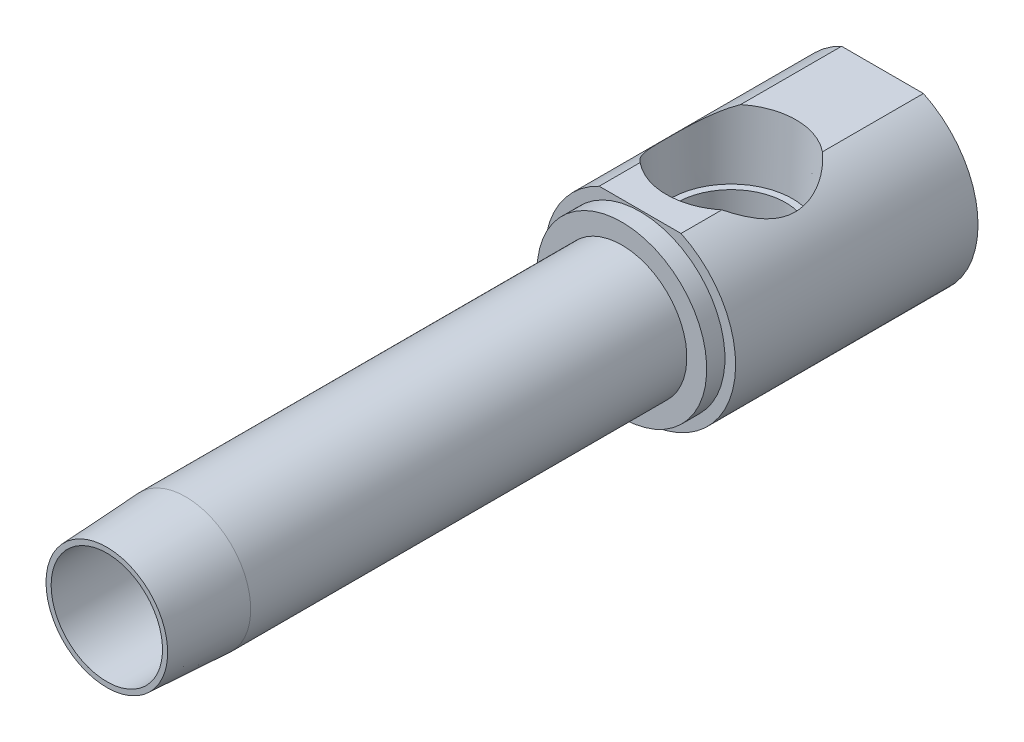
ISO-10303-21;
HEADER;
FILE_DESCRIPTION(('STEP AP214'),'2;1');
FILE_NAME('part.step','',(''),(''),'','','');
FILE_SCHEMA(('AUTOMOTIVE_DESIGN { 1 0 10303 214 1 1 1 1 }'));
ENDSEC;
DATA;
#1=APPLICATION_CONTEXT('core data for automotive mechanical design processes');
#2=APPLICATION_PROTOCOL_DEFINITION('international standard','automotive_design',2000,#1);
#3=PRODUCT_CONTEXT('',#1,'mechanical');
#4=PRODUCT('Part','Part','',(#3));
#5=PRODUCT_RELATED_PRODUCT_CATEGORY('part','',(#4));
#6=PRODUCT_DEFINITION_FORMATION('','',#4);
#7=PRODUCT_DEFINITION_CONTEXT('part definition',#1,'design');
#8=PRODUCT_DEFINITION('design','',#6,#7);
#9=PRODUCT_DEFINITION_SHAPE('','',#8);
#10=(LENGTH_UNIT() NAMED_UNIT(*) SI_UNIT(.MILLI.,.METRE.));
#11=(NAMED_UNIT(*) PLANE_ANGLE_UNIT() SI_UNIT($,.RADIAN.));
#12=(NAMED_UNIT(*) SI_UNIT($,.STERADIAN.) SOLID_ANGLE_UNIT());
#13=UNCERTAINTY_MEASURE_WITH_UNIT(LENGTH_MEASURE(1.E-05),#10,'distance_accuracy_value','');
#14=(GEOMETRIC_REPRESENTATION_CONTEXT(3) GLOBAL_UNCERTAINTY_ASSIGNED_CONTEXT((#13)) GLOBAL_UNIT_ASSIGNED_CONTEXT((#10,
#11,#12)) REPRESENTATION_CONTEXT('',''));
#15=CARTESIAN_POINT('',(0.,0.,0.));
#16=DIRECTION('',(0.,0.,1.));
#17=DIRECTION('',(1.,0.,0.));
#18=AXIS2_PLACEMENT_3D('',#15,#16,#17);
#19=CARTESIAN_POINT('',(-7.29488,0.,0.));
#20=DIRECTION('',(0.,0.,1.));
#21=DIRECTION('',(1.,0.,0.));
#22=AXIS2_PLACEMENT_3D('',#19,#20,#21);
#23=PLANE('',#22);
#24=CARTESIAN_POINT('',(0.,0.,0.));
#25=DIRECTION('',(0.,0.,-1.));
#26=DIRECTION('',(-1.,0.,0.));
#27=AXIS2_PLACEMENT_3D('',#24,#25,#26);
#28=CIRCLE('',#27,7.29488);
#29=CARTESIAN_POINT('',(-7.29488,0.,0.));
#30=VERTEX_POINT('',#29);
#31=EDGE_CURVE('E18',#30,#30,#28,.T.);
#32=ORIENTED_EDGE('',*,*,#31,.T.);
#33=EDGE_LOOP('',(#32));
#34=FACE_BOUND('',#33,.T.);
#35=CARTESIAN_POINT('',(0.,0.,0.));
#36=DIRECTION('',(0.,0.,-1.));
#37=DIRECTION('',(-1.,0.,0.));
#38=AXIS2_PLACEMENT_3D('',#35,#36,#37);
#39=CIRCLE('',#38,7.96721885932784);
#40=CARTESIAN_POINT('',(-7.96721885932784,0.,0.));
#41=VERTEX_POINT('',#40);
#42=EDGE_CURVE('E318',#41,#41,#39,.T.);
#43=ORIENTED_EDGE('',*,*,#42,.F.);
#44=EDGE_LOOP('',(#43));
#45=FACE_BOUND('',#44,.T.);
#46=ADVANCED_FACE('F15',(#34,#45),#23,.T.);
#47=CARTESIAN_POINT('',(0.,0.,-132.347166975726));
#48=DIRECTION('',(0.,0.,-1.));
#49=DIRECTION('',(-1.,0.,0.));
#50=AXIS2_PLACEMENT_3D('',#47,#48,#49);
#51=CYLINDRICAL_SURFACE('',#50,8.509);
#52=CARTESIAN_POINT('',(0.,0.,-10.3378));
#53=DIRECTION('',(0.,0.,-1.));
#54=DIRECTION('',(-1.,0.,0.));
#55=AXIS2_PLACEMENT_3D('',#52,#53,#54);
#56=CIRCLE('',#55,8.509);
#57=CARTESIAN_POINT('',(-8.509,0.,-10.3378));
#58=VERTEX_POINT('',#57);
#59=EDGE_CURVE('E320',#58,#58,#56,.T.);
#60=ORIENTED_EDGE('',*,*,#59,.T.);
#61=EDGE_LOOP('',(#60));
#62=FACE_BOUND('',#61,.T.);
#63=CARTESIAN_POINT('',(0.,0.,-67.4624));
#64=DIRECTION('',(0.,0.,-1.));
#65=DIRECTION('',(-1.,0.,0.));
#66=AXIS2_PLACEMENT_3D('',#63,#64,#65);
#67=CIRCLE('',#66,8.509);
#68=CARTESIAN_POINT('',(-8.509,0.,-67.4624));
#69=VERTEX_POINT('',#68);
#70=EDGE_CURVE('E152',#69,#69,#67,.T.);
#71=ORIENTED_EDGE('',*,*,#70,.F.);
#72=EDGE_LOOP('',(#71));
#73=FACE_BOUND('',#72,.T.);
#74=ADVANCED_FACE('F226',(#62,#73),#51,.T.);
#75=CARTESIAN_POINT('',(-5.3594,11.3032925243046,-57.15));
#76=DIRECTION('',(0.,-1.,0.));
#77=DIRECTION('',(0.,0.,-1.));
#78=AXIS2_PLACEMENT_3D('',#75,#76,#77);
#79=PLANE('',#78);
#80=DIRECTION('',(0.,0.,-1.));
#81=VECTOR('',#80,1.);
#82=CARTESIAN_POINT('',(5.3594,11.3032925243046,-57.15));
#83=LINE('',#82,#81);
#84=CARTESIAN_POINT('',(5.3594,11.3032925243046,-69.85));
#85=VERTEX_POINT('',#84);
#86=CARTESIAN_POINT('',(5.3594,11.3032925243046,-75.2032394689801));
#87=VERTEX_POINT('',#86);
#88=EDGE_CURVE('E136',#85,#87,#83,.T.);
#89=ORIENTED_EDGE('',*,*,#88,.T.);
#90=CARTESIAN_POINT('',(0.,11.3032925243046,-81.788));
#91=DIRECTION('',(0.,-1.,0.));
#92=DIRECTION('',(0.,0.,-1.));
#93=AXIS2_PLACEMENT_3D('',#90,#91,#92);
#94=CIRCLE('',#93,8.49012600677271);
#95=CARTESIAN_POINT('',(-5.3594,11.3032925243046,-75.2032394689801));
#96=VERTEX_POINT('',#95);
#97=EDGE_CURVE('E122',#87,#96,#94,.T.);
#98=ORIENTED_EDGE('',*,*,#97,.T.);
#99=DIRECTION('',(0.,0.,-1.));
#100=VECTOR('',#99,1.);
#101=CARTESIAN_POINT('',(-5.3594,11.3032925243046,-57.15));
#102=LINE('',#101,#100);
#103=CARTESIAN_POINT('',(-5.3594,11.3032925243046,-69.85));
#104=VERTEX_POINT('',#103);
#105=EDGE_CURVE('E147',#104,#96,#102,.T.);
#106=ORIENTED_EDGE('',*,*,#105,.F.);
#107=DIRECTION('',(1.,0.,0.));
#108=VECTOR('',#107,1.);
#109=CARTESIAN_POINT('',(-11.1125,11.3032925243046,-69.85));
#110=LINE('',#109,#108);
#111=EDGE_CURVE('E144',#104,#85,#110,.T.);
#112=ORIENTED_EDGE('',*,*,#111,.T.);
#113=EDGE_LOOP('',(#89,#98,#106,#112));
#114=FACE_BOUND('',#113,.T.);
#115=ADVANCED_FACE('F142',(#114),#79,.F.);
#116=CARTESIAN_POINT('',(0.,0.,-132.347166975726));
#117=DIRECTION('',(0.,0.,-1.));
#118=DIRECTION('',(-1.,0.,0.));
#119=AXIS2_PLACEMENT_3D('',#116,#117,#118);
#120=CYLINDRICAL_SURFACE('',#119,7.29488);
#121=ORIENTED_EDGE('',*,*,#31,.F.);
#122=EDGE_LOOP('',(#121));
#123=FACE_BOUND('',#122,.T.);
#124=CARTESIAN_POINT('',(0.,0.,-67.31));
#125=DIRECTION('',(0.,0.,-1.));
#126=DIRECTION('',(-1.,0.,0.));
#127=AXIS2_PLACEMENT_3D('',#124,#125,#126);
#128=CIRCLE('',#127,7.29488);
#129=CARTESIAN_POINT('',(-2.83926860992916,-6.71965981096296,-67.31));
#130=VERTEX_POINT('',#129);
#131=CARTESIAN_POINT('',(2.83926860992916,-6.71965981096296,-67.31));
#132=VERTEX_POINT('',#131);
#133=EDGE_CURVE('E166',#130,#132,#128,.T.);
#134=ORIENTED_EDGE('',*,*,#133,.T.);
#135=CARTESIAN_POINT('',(2.83926860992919,-6.71965981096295,-67.31));
#136=CARTESIAN_POINT('',(2.70908587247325,-6.77470567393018,-67.2520217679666));
#137=CARTESIAN_POINT('',(2.57545350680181,-6.82667201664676,-67.1989157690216));
#138=CARTESIAN_POINT('',(2.30236644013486,-6.92352687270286,-67.1021649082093));
#139=CARTESIAN_POINT('',(2.16291320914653,-6.96841715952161,-67.0585176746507));
#140=CARTESIAN_POINT('',(1.8794201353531,-7.05016472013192,-66.9804342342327));
#141=CARTESIAN_POINT('',(1.7353879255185,-7.08703463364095,-66.9459835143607));
#142=CARTESIAN_POINT('',(1.44358277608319,-7.1521803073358,-66.8859182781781));
#143=CARTESIAN_POINT('',(1.2958096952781,-7.18045574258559,-66.8603040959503));
#144=CARTESIAN_POINT('',(0.997667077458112,-7.22791200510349,-66.8176927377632));
#145=CARTESIAN_POINT('',(0.847298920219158,-7.2470975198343,-66.800691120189));
#146=CARTESIAN_POINT('',(0.54494598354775,-7.27608226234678,-66.7751201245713));
#147=CARTESIAN_POINT('',(0.392961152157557,-7.28588118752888,-66.7665510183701));
#148=CARTESIAN_POINT('',(0.0883390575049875,-7.29593786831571,-66.7577574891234));
#149=CARTESIAN_POINT('',(-0.0642985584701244,-7.29618956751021,-66.7575383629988));
#150=CARTESIAN_POINT('',(-0.369068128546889,-7.28713276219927,-66.7654558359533));
#151=CARTESIAN_POINT('',(-0.52120009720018,-7.27782453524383,-66.7735921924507));
#152=CARTESIAN_POINT('',(-0.825795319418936,-7.24962203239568,-66.7984560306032));
#153=CARTESIAN_POINT('',(-0.978239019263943,-7.23060958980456,-66.8152894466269));
#154=CARTESIAN_POINT('',(-1.28042184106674,-7.18325692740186,-66.8577720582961));
#155=CARTESIAN_POINT('',(-1.43016107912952,-7.15491710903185,-66.8834208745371));
#156=CARTESIAN_POINT('',(-1.72558403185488,-7.0894631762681,-66.9437204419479));
#157=CARTESIAN_POINT('',(-1.87127414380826,-7.05236389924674,-66.9783559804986));
#158=CARTESIAN_POINT('',(-2.15770494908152,-6.97006186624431,-67.0569252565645));
#159=CARTESIAN_POINT('',(-2.2984485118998,-6.92486390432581,-67.1008534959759));
#160=CARTESIAN_POINT('',(-2.50498218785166,-6.85169148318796,-67.1739115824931));
#161=CARTESIAN_POINT('',(-2.57303323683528,-6.8264174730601,-67.199445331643));
#162=CARTESIAN_POINT('',(-2.70743134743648,-6.77423657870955,-67.2529103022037));
#163=CARTESIAN_POINT('',(-2.77378053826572,-6.74733189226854,-67.2808383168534));
#164=CARTESIAN_POINT('',(-2.83926860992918,-6.7196598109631,-67.31));
#165=B_SPLINE_CURVE_WITH_KNOTS('',3,(#135,#136,#137,#138,#139,#140,#141,#142,#143,#144,#145,
#146,#147,#148,#149,#150,#151,#152,#153,#154,#155,#156,#157,#158,#159,#160,#161,#162,#163,#164),
.UNSPECIFIED.,.F.,.F.,(4,2,2,2,2,2,2,2,2,2,2,2,2,2,4),(0.,0.458141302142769,0.916167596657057,
1.3734667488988,1.83078318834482,2.28786354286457,2.74495863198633,3.20234368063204,
3.65971545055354,4.12279436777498,4.58585335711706,5.04813354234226,5.51014097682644,
5.74093493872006,5.97142447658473),.UNSPECIFIED.);
#166=EDGE_CURVE('E228',#132,#130,#165,.T.);
#167=ORIENTED_EDGE('',*,*,#166,.T.);
#168=EDGE_LOOP('',(#134,#167));
#169=FACE_BOUND('',#168,.T.);
#170=ADVANCED_FACE('F221',(#123,#169),#120,.F.);
#171=CARTESIAN_POINT('',(-7.29488,0.,-67.31));
#172=DIRECTION('',(0.,0.,1.));
#173=DIRECTION('',(1.,0.,0.));
#174=AXIS2_PLACEMENT_3D('',#171,#172,#173);
#175=PLANE('',#174);
#176=ORIENTED_EDGE('',*,*,#133,.F.);
#177=CARTESIAN_POINT('',(0.,-0.996470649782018,-67.31));
#178=DIRECTION('',(0.,0.,1.));
#179=DIRECTION('',(0.,-1.,0.));
#180=AXIS2_PLACEMENT_3D('',#177,#178,#179);
#181=ELLIPSE('',#180,6.41876281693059,6.27107494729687);
#182=EDGE_CURVE('E170',#130,#132,#181,.F.);
#183=ORIENTED_EDGE('',*,*,#182,.T.);
#184=EDGE_LOOP('',(#176,#183));
#185=FACE_BOUND('',#184,.T.);
#186=ADVANCED_FACE('F217',(#185),#175,.T.);
#187=CARTESIAN_POINT('',(-12.5095,0.,-101.6));
#188=DIRECTION('',(0.,0.,-1.));
#189=DIRECTION('',(-1.,0.,0.));
#190=AXIS2_PLACEMENT_3D('',#187,#188,#189);
#191=PLANE('',#190);
#192=DIRECTION('',(1.,0.,0.));
#193=VECTOR('',#192,1.);
#194=CARTESIAN_POINT('',(-3.66617420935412,6.35,-101.6));
#195=LINE('',#194,#193);
#196=CARTESIAN_POINT('',(-3.66617420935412,6.35,-101.6));
#197=VERTEX_POINT('',#196);
#198=CARTESIAN_POINT('',(3.66617420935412,6.35,-101.6));
#199=VERTEX_POINT('',#198);
#200=EDGE_CURVE('E235',#197,#199,#195,.T.);
#201=ORIENTED_EDGE('',*,*,#200,.F.);
#202=DIRECTION('',(0.5,0.866025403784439,0.));
#203=VECTOR('',#202,1.);
#204=CARTESIAN_POINT('',(-7.33234841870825,0.,-101.6));
#205=LINE('',#204,#203);
#206=CARTESIAN_POINT('',(-7.33234841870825,0.,-101.6));
#207=VERTEX_POINT('',#206);
#208=EDGE_CURVE('E242',#207,#197,#205,.T.);
#209=ORIENTED_EDGE('',*,*,#208,.F.);
#210=DIRECTION('',(-0.5,0.866025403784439,0.));
#211=VECTOR('',#210,1.);
#212=CARTESIAN_POINT('',(-3.66617420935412,-6.35,-101.6));
#213=LINE('',#212,#211);
#214=CARTESIAN_POINT('',(-3.66617420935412,-6.35,-101.6));
#215=VERTEX_POINT('',#214);
#216=EDGE_CURVE('E268',#215,#207,#213,.T.);
#217=ORIENTED_EDGE('',*,*,#216,.F.);
#218=DIRECTION('',(-1.,0.,0.));
#219=VECTOR('',#218,1.);
#220=CARTESIAN_POINT('',(3.66617420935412,-6.35,-101.6));
#221=LINE('',#220,#219);
#222=CARTESIAN_POINT('',(3.66617420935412,-6.35,-101.6));
#223=VERTEX_POINT('',#222);
#224=EDGE_CURVE('E265',#223,#215,#221,.T.);
#225=ORIENTED_EDGE('',*,*,#224,.F.);
#226=DIRECTION('',(-0.5,-0.866025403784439,0.));
#227=VECTOR('',#226,1.);
#228=CARTESIAN_POINT('',(7.33234841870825,0.,-101.6));
#229=LINE('',#228,#227);
#230=CARTESIAN_POINT('',(7.33234841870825,0.,-101.6));
#231=VERTEX_POINT('',#230);
#232=EDGE_CURVE('E262',#231,#223,#229,.T.);
#233=ORIENTED_EDGE('',*,*,#232,.F.);
#234=DIRECTION('',(0.5,-0.866025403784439,0.));
#235=VECTOR('',#234,1.);
#236=CARTESIAN_POINT('',(3.66617420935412,6.35,-101.6));
#237=LINE('',#236,#235);
#238=EDGE_CURVE('E259',#199,#231,#237,.T.);
#239=ORIENTED_EDGE('',*,*,#238,.F.);
#240=EDGE_LOOP('',(#201,#209,#217,#225,#233,#239));
#241=FACE_BOUND('',#240,.T.);
#242=DIRECTION('',(-1.,0.,0.));
#243=VECTOR('',#242,1.);
#244=CARTESIAN_POINT('',(-5.3594,11.3032925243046,-101.6));
#245=LINE('',#244,#243);
#246=CARTESIAN_POINT('',(5.3594,11.3032925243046,-101.6));
#247=VERTEX_POINT('',#246);
#248=CARTESIAN_POINT('',(-5.3594,11.3032925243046,-101.6));
#249=VERTEX_POINT('',#248);
#250=EDGE_CURVE('E149',#247,#249,#245,.T.);
#251=ORIENTED_EDGE('',*,*,#250,.F.);
#252=CARTESIAN_POINT('',(0.,0.,-101.6));
#253=DIRECTION('',(0.,0.,-1.));
#254=DIRECTION('',(-1.,0.,0.));
#255=AXIS2_PLACEMENT_3D('',#252,#253,#254);
#256=CIRCLE('',#255,12.5095);
#257=EDGE_CURVE('E163',#247,#249,#256,.T.);
#258=ORIENTED_EDGE('',*,*,#257,.T.);
#259=EDGE_LOOP('',(#251,#258));
#260=FACE_BOUND('',#259,.T.);
#261=ADVANCED_FACE('F212',(#241,#260),#191,.T.);
#262=CARTESIAN_POINT('',(0.,0.,-132.347166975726));
#263=DIRECTION('',(0.,0.,-1.));
#264=DIRECTION('',(-1.,0.,0.));
#265=AXIS2_PLACEMENT_3D('',#262,#263,#264);
#266=CYLINDRICAL_SURFACE('',#265,12.5095);
#267=CARTESIAN_POINT('',(5.3589781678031,11.3034925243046,-75.2028826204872));
#268=CARTESIAN_POINT('',(5.54921369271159,11.2133234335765,-75.3638407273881));
#269=CARTESIAN_POINT('',(5.73165431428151,11.1209258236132,-75.532665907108));
#270=CARTESIAN_POINT('',(6.08048620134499,10.9340894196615,-75.8852208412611));
#271=CARTESIAN_POINT('',(6.24687354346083,10.8396501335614,-76.0689542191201));
#272=CARTESIAN_POINT('',(6.56420314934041,10.650502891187,-76.4518126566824));
#273=CARTESIAN_POINT('',(6.71502345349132,10.5557980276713,-76.6510405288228));
#274=CARTESIAN_POINT('',(6.99914257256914,10.3695935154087,-77.0628637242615));
#275=CARTESIAN_POINT('',(7.13244448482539,10.2780933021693,-77.2754566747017));
#276=CARTESIAN_POINT('',(7.46650834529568,10.0401700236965,-77.8646742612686));
#277=CARTESIAN_POINT('',(7.65054804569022,9.899293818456,-78.2534819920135));
#278=CARTESIAN_POINT('',(7.88323238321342,9.71350267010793,-78.8599632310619));
#279=CARTESIAN_POINT('',(7.95350713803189,9.65587918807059,-79.0657452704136));
#280=CARTESIAN_POINT('',(8.07900681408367,9.55112103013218,-79.4845154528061));
#281=CARTESIAN_POINT('',(8.1342346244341,9.50398434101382,-79.6975022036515));
#282=CARTESIAN_POINT('',(8.22106638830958,9.42891275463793,-80.0941071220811));
#283=CARTESIAN_POINT('',(8.25505388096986,9.39910020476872,-80.2768521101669));
#284=CARTESIAN_POINT('',(8.31144289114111,9.34927427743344,-80.6454304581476));
#285=CARTESIAN_POINT('',(8.33384667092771,9.32925898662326,-80.8312632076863));
#286=CARTESIAN_POINT('',(8.36672861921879,9.29978140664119,-81.2047275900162));
#287=CARTESIAN_POINT('',(8.37721265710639,9.29031392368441,-81.3923582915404));
#288=CARTESIAN_POINT('',(8.3861052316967,9.28228778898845,-81.7681465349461));
#289=CARTESIAN_POINT('',(8.38451351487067,9.28372936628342,-81.9563040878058));
#290=CARTESIAN_POINT('',(8.36928475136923,9.29746017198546,-82.3316139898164));
#291=CARTESIAN_POINT('',(8.35565497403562,9.30974285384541,-82.5187668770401));
#292=CARTESIAN_POINT('',(8.3165791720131,9.3446659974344,-82.890843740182));
#293=CARTESIAN_POINT('',(8.2911332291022,9.36730638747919,-83.075767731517));
#294=CARTESIAN_POINT('',(8.22876601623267,9.42213985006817,-83.442394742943));
#295=CARTESIAN_POINT('',(8.19183425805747,9.454341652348,-83.6240946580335));
#296=CARTESIAN_POINT('',(8.10694730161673,9.52723048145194,-83.9832473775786));
#297=CARTESIAN_POINT('',(8.0589858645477,9.56792230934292,-84.1606977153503));
#298=CARTESIAN_POINT('',(7.93720028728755,9.66935365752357,-84.5609579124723));
#299=CARTESIAN_POINT('',(7.85990590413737,9.73249157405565,-84.7821095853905));
#300=CARTESIAN_POINT('',(7.68886075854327,9.86817719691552,-85.2149768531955));
#301=CARTESIAN_POINT('',(7.59510436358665,9.94072812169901,-85.426689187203));
#302=CARTESIAN_POINT('',(7.39186656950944,10.092770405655,-85.8402308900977));
#303=CARTESIAN_POINT('',(7.28236248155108,10.172271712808,-86.0420454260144));
#304=CARTESIAN_POINT('',(7.04849385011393,10.3357003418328,-86.4348508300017));
#305=CARTESIAN_POINT('',(6.92413202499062,10.4196268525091,-86.6258436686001));
#306=CARTESIAN_POINT('',(6.58695562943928,10.637641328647,-87.1010218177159));
#307=CARTESIAN_POINT('',(6.36373226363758,10.7733928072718,-87.3772036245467));
#308=CARTESIAN_POINT('',(6.00459360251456,10.9750283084,-87.7684604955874));
#309=CARTESIAN_POINT('',(5.88113847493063,11.0417585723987,-87.8947819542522));
#310=CARTESIAN_POINT('',(5.62611191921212,11.1738564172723,-88.1397690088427));
#311=CARTESIAN_POINT('',(5.49453878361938,11.2392237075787,-88.2584329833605));
#312=CARTESIAN_POINT('',(5.3589781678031,11.3034925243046,-88.3731173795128));
#313=B_SPLINE_CURVE_WITH_KNOTS('',3,(#267,#268,#269,#270,#271,#272,#273,#274,#275,#276,#277,
#278,#279,#280,#281,#282,#283,#284,#285,#286,#287,#288,#289,#290,#291,#292,#293,#294,#295,#296,
#297,#298,#299,#300,#301,#302,#303,#304,#305,#306,#307,#308,#309,#310,#311,#312),.UNSPECIFIED.,
.F.,.F.,(4,2,2,2,2,2,2,2,2,2,2,2,2,2,2,2,2,2,2,2,2,2,4),(0.,0.794684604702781,1.58956293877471,
2.39025916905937,3.19081364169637,4.54240556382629,5.21661127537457,5.89068744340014,
6.4548654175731,7.01893316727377,7.58272304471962,8.14652475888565,8.7099862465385,
9.27344383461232,9.83741745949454,10.4017108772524,11.128553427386,11.8556451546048,
12.5837951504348,13.3118121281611,14.449296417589,15.0154674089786,15.5817578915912),.UNSPECIFIED.);
#314=CARTESIAN_POINT('',(5.3594,11.3032925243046,-88.3727605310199));
#315=VERTEX_POINT('',#314);
#316=EDGE_CURVE('E30',#87,#315,#313,.T.);
#317=ORIENTED_EDGE('',*,*,#316,.F.);
#318=ORIENTED_EDGE('',*,*,#88,.F.);
#319=CARTESIAN_POINT('',(0.,0.,-69.85));
#320=DIRECTION('',(0.,0.,-1.));
#321=DIRECTION('',(-1.,0.,0.));
#322=AXIS2_PLACEMENT_3D('',#319,#320,#321);
#323=CIRCLE('',#322,12.5095);
#324=EDGE_CURVE('E161',#85,#104,#323,.T.);
#325=ORIENTED_EDGE('',*,*,#324,.T.);
#326=ORIENTED_EDGE('',*,*,#105,.T.);
#327=CARTESIAN_POINT('',(-5.3589781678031,11.3034925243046,-88.3731173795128));
#328=CARTESIAN_POINT('',(-5.54921369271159,11.2133234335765,-88.2121592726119));
#329=CARTESIAN_POINT('',(-5.73165431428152,11.1209258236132,-88.043334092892));
#330=CARTESIAN_POINT('',(-6.08048620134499,10.9340894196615,-87.6907791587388));
#331=CARTESIAN_POINT('',(-6.24687354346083,10.8396501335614,-87.5070457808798));
#332=CARTESIAN_POINT('',(-6.56420314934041,10.650502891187,-87.1241873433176));
#333=CARTESIAN_POINT('',(-6.71502345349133,10.5557980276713,-86.9249594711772));
#334=CARTESIAN_POINT('',(-6.99914257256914,10.3695935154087,-86.5131362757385));
#335=CARTESIAN_POINT('',(-7.13244448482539,10.2780933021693,-86.3005433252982));
#336=CARTESIAN_POINT('',(-7.46650834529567,10.0401700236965,-85.7113257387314));
#337=CARTESIAN_POINT('',(-7.65054804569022,9.899293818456,-85.3225180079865));
#338=CARTESIAN_POINT('',(-7.8832323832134,9.71350267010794,-84.7160367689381));
#339=CARTESIAN_POINT('',(-7.95350713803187,9.6558791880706,-84.5102547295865));
#340=CARTESIAN_POINT('',(-8.07900681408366,9.55112103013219,-84.091484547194));
#341=CARTESIAN_POINT('',(-8.13423462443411,9.50398434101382,-83.8784977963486));
#342=CARTESIAN_POINT('',(-8.22106638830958,9.42891275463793,-83.481892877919));
#343=CARTESIAN_POINT('',(-8.25505388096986,9.39910020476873,-83.2991478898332));
#344=CARTESIAN_POINT('',(-8.3114428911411,9.34927427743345,-82.9305695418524));
#345=CARTESIAN_POINT('',(-8.33384667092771,9.32925898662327,-82.7447367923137));
#346=CARTESIAN_POINT('',(-8.36672861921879,9.29978140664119,-82.3712724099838));
#347=CARTESIAN_POINT('',(-8.37721265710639,9.29031392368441,-82.1836417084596));
#348=CARTESIAN_POINT('',(-8.3861052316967,9.28228778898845,-81.807853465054));
#349=CARTESIAN_POINT('',(-8.38451351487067,9.28372936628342,-81.6196959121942));
#350=CARTESIAN_POINT('',(-8.36928475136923,9.29746017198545,-81.2443860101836));
#351=CARTESIAN_POINT('',(-8.35565497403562,9.30974285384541,-81.0572331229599));
#352=CARTESIAN_POINT('',(-8.31657917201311,9.3446659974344,-80.6851562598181));
#353=CARTESIAN_POINT('',(-8.29113322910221,9.36730638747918,-80.5002322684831));
#354=CARTESIAN_POINT('',(-8.22876601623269,9.42213985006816,-80.1336052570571));
#355=CARTESIAN_POINT('',(-8.19183425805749,9.45434165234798,-79.9519053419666));
#356=CARTESIAN_POINT('',(-8.10694730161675,9.52723048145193,-79.5927526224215));
#357=CARTESIAN_POINT('',(-8.0589858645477,9.56792230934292,-79.4153022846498));
#358=CARTESIAN_POINT('',(-7.93720028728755,9.66935365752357,-79.0150420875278));
#359=CARTESIAN_POINT('',(-7.85990590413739,9.73249157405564,-78.7938904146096));
#360=CARTESIAN_POINT('',(-7.6888607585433,9.8681771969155,-78.3610231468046));
#361=CARTESIAN_POINT('',(-7.59510436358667,9.94072812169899,-78.1493108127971));
#362=CARTESIAN_POINT('',(-7.39186656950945,10.0927704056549,-77.7357691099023));
#363=CARTESIAN_POINT('',(-7.28236248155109,10.172271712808,-77.5339545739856));
#364=CARTESIAN_POINT('',(-7.04849385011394,10.3357003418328,-77.1411491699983));
#365=CARTESIAN_POINT('',(-6.92413202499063,10.4196268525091,-76.9501563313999));
#366=CARTESIAN_POINT('',(-6.58695562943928,10.637641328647,-76.4749781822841));
#367=CARTESIAN_POINT('',(-6.36373226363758,10.7733928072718,-76.1987963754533));
#368=CARTESIAN_POINT('',(-6.00459360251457,10.9750283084,-75.8075395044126));
#369=CARTESIAN_POINT('',(-5.88113847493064,11.0417585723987,-75.6812180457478));
#370=CARTESIAN_POINT('',(-5.62611191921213,11.1738564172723,-75.4362309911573));
#371=CARTESIAN_POINT('',(-5.49453878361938,11.2392237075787,-75.3175670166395));
#372=CARTESIAN_POINT('',(-5.3589781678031,11.3034925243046,-75.2028826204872));
#373=B_SPLINE_CURVE_WITH_KNOTS('',3,(#327,#328,#329,#330,#331,#332,#333,#334,#335,#336,#337,
#338,#339,#340,#341,#342,#343,#344,#345,#346,#347,#348,#349,#350,#351,#352,#353,#354,#355,#356,
#357,#358,#359,#360,#361,#362,#363,#364,#365,#366,#367,#368,#369,#370,#371,#372),.UNSPECIFIED.,
.F.,.F.,(4,2,2,2,2,2,2,2,2,2,2,2,2,2,2,2,2,2,2,2,2,2,4),(0.,0.794684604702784,1.58956293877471,
2.39025916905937,3.19081364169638,4.54240556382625,5.21661127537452,5.89068744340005,
6.45486541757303,7.01893316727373,7.5827230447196,8.14652475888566,8.70998624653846,
9.27344383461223,9.83741745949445,10.4017108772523,11.1285534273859,11.8556451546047,
12.5837951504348,13.3118121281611,14.449296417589,15.0154674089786,15.5817578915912),.UNSPECIFIED.);
#374=CARTESIAN_POINT('',(-5.3594,11.3032925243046,-88.3727605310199));
#375=VERTEX_POINT('',#374);
#376=EDGE_CURVE('E125',#375,#96,#373,.T.);
#377=ORIENTED_EDGE('',*,*,#376,.F.);
#378=EDGE_CURVE('E145',#375,#249,#102,.T.);
#379=ORIENTED_EDGE('',*,*,#378,.T.);
#380=ORIENTED_EDGE('',*,*,#257,.F.);
#381=EDGE_CURVE('E139',#315,#247,#83,.T.);
#382=ORIENTED_EDGE('',*,*,#381,.F.);
#383=EDGE_LOOP('',(#317,#318,#325,#326,#377,#379,#380,#382));
#384=FACE_BOUND('',#383,.T.);
#385=ADVANCED_FACE('F134',(#384),#266,.T.);
#386=CARTESIAN_POINT('',(-11.1125,0.,-69.85));
#387=DIRECTION('',(0.,0.,1.));
#388=DIRECTION('',(1.,0.,0.));
#389=AXIS2_PLACEMENT_3D('',#386,#387,#388);
#390=PLANE('',#389);
#391=ORIENTED_EDGE('',*,*,#111,.F.);
#392=ORIENTED_EDGE('',*,*,#324,.F.);
#393=EDGE_LOOP('',(#391,#392));
#394=FACE_BOUND('',#393,.T.);
#395=CARTESIAN_POINT('',(0.,0.,-69.85));
#396=DIRECTION('',(0.,0.,-1.));
#397=DIRECTION('',(-1.,0.,0.));
#398=AXIS2_PLACEMENT_3D('',#395,#396,#397);
#399=CIRCLE('',#398,11.1125);
#400=CARTESIAN_POINT('',(-11.1125,0.,-69.85));
#401=VERTEX_POINT('',#400);
#402=EDGE_CURVE('E158',#401,#401,#399,.T.);
#403=ORIENTED_EDGE('',*,*,#402,.T.);
#404=EDGE_LOOP('',(#403));
#405=FACE_BOUND('',#404,.T.);
#406=ADVANCED_FACE('F211',(#394,#405),#390,.T.);
#407=CARTESIAN_POINT('',(0.,0.,-132.347166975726));
#408=DIRECTION('',(0.,0.,-1.));
#409=DIRECTION('',(-1.,0.,0.));
#410=AXIS2_PLACEMENT_3D('',#407,#408,#409);
#411=CYLINDRICAL_SURFACE('',#410,11.1125);
#412=CARTESIAN_POINT('',(0.,0.,-67.4624));
#413=DIRECTION('',(0.,0.,-1.));
#414=DIRECTION('',(-1.,0.,0.));
#415=AXIS2_PLACEMENT_3D('',#412,#413,#414);
#416=CIRCLE('',#415,11.1125);
#417=CARTESIAN_POINT('',(-11.1125,0.,-67.4624));
#418=VERTEX_POINT('',#417);
#419=EDGE_CURVE('E155',#418,#418,#416,.T.);
#420=ORIENTED_EDGE('',*,*,#419,.T.);
#421=EDGE_LOOP('',(#420));
#422=FACE_BOUND('',#421,.T.);
#423=ORIENTED_EDGE('',*,*,#402,.F.);
#424=EDGE_LOOP('',(#423));
#425=FACE_BOUND('',#424,.T.);
#426=ADVANCED_FACE('F293',(#422,#425),#411,.T.);
#427=CARTESIAN_POINT('',(-8.509,0.,-67.4624));
#428=DIRECTION('',(0.,0.,1.));
#429=DIRECTION('',(1.,0.,0.));
#430=AXIS2_PLACEMENT_3D('',#427,#428,#429);
#431=PLANE('',#430);
#432=ORIENTED_EDGE('',*,*,#70,.T.);
#433=EDGE_LOOP('',(#432));
#434=FACE_BOUND('',#433,.T.);
#435=ORIENTED_EDGE('',*,*,#419,.F.);
#436=EDGE_LOOP('',(#435));
#437=FACE_BOUND('',#436,.T.);
#438=ADVANCED_FACE('F297',(#434,#437),#431,.T.);
#439=ORIENTED_EDGE('',*,*,#378,.F.);
#440=EDGE_CURVE('E129',#375,#315,#94,.T.);
#441=ORIENTED_EDGE('',*,*,#440,.T.);
#442=ORIENTED_EDGE('',*,*,#381,.T.);
#443=ORIENTED_EDGE('',*,*,#250,.T.);
#444=EDGE_LOOP('',(#439,#441,#442,#443));
#445=FACE_BOUND('',#444,.T.);
#446=ADVANCED_FACE('F288',(#445),#79,.F.);
#447=CARTESIAN_POINT('',(-3.66617420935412,6.35,-95.25));
#448=DIRECTION('',(0.,1.,0.));
#449=DIRECTION('',(-1.,0.,0.));
#450=AXIS2_PLACEMENT_3D('',#447,#448,#449);
#451=PLANE('',#450);
#452=ORIENTED_EDGE('',*,*,#200,.T.);
#453=DIRECTION('',(0.,0.,-1.));
#454=VECTOR('',#453,1.);
#455=CARTESIAN_POINT('',(3.66617420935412,6.35,-95.25));
#456=LINE('',#455,#454);
#457=CARTESIAN_POINT('',(3.66617420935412,6.35,-95.25));
#458=VERTEX_POINT('',#457);
#459=EDGE_CURVE('E257',#458,#199,#456,.T.);
#460=ORIENTED_EDGE('',*,*,#459,.F.);
#461=DIRECTION('',(1.,0.,0.));
#462=VECTOR('',#461,1.);
#463=CARTESIAN_POINT('',(-3.66617420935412,6.35,-95.25));
#464=LINE('',#463,#462);
#465=CARTESIAN_POINT('',(-3.66617420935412,6.35,-95.25));
#466=VERTEX_POINT('',#465);
#467=EDGE_CURVE('E238',#466,#458,#464,.T.);
#468=ORIENTED_EDGE('',*,*,#467,.F.);
#469=DIRECTION('',(0.,0.,-1.));
#470=VECTOR('',#469,1.);
#471=CARTESIAN_POINT('',(-3.66617420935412,6.35,-95.25));
#472=LINE('',#471,#470);
#473=EDGE_CURVE('E273',#466,#197,#472,.T.);
#474=ORIENTED_EDGE('',*,*,#473,.T.);
#475=EDGE_LOOP('',(#452,#460,#468,#474));
#476=FACE_BOUND('',#475,.T.);
#477=ADVANCED_FACE('F392',(#476),#451,.F.);
#478=CARTESIAN_POINT('',(-7.33234841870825,0.,-95.25));
#479=DIRECTION('',(-0.866025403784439,0.5,0.));
#480=DIRECTION('',(-0.5,-0.866025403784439,0.));
#481=AXIS2_PLACEMENT_3D('',#478,#479,#480);
#482=PLANE('',#481);
#483=ORIENTED_EDGE('',*,*,#208,.T.);
#484=ORIENTED_EDGE('',*,*,#473,.F.);
#485=DIRECTION('',(0.5,0.866025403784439,0.));
#486=VECTOR('',#485,1.);
#487=CARTESIAN_POINT('',(-7.33234841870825,0.,-95.25));
#488=LINE('',#487,#486);
#489=CARTESIAN_POINT('',(-7.33234841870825,0.,-95.25));
#490=VERTEX_POINT('',#489);
#491=EDGE_CURVE('E254',#490,#466,#488,.T.);
#492=ORIENTED_EDGE('',*,*,#491,.F.);
#493=DIRECTION('',(0.,0.,-1.));
#494=VECTOR('',#493,1.);
#495=CARTESIAN_POINT('',(-7.33234841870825,0.,-95.25));
#496=LINE('',#495,#494);
#497=EDGE_CURVE('E275',#490,#207,#496,.T.);
#498=ORIENTED_EDGE('',*,*,#497,.T.);
#499=EDGE_LOOP('',(#483,#484,#492,#498));
#500=FACE_BOUND('',#499,.T.);
#501=ADVANCED_FACE('F388',(#500),#482,.F.);
#502=CARTESIAN_POINT('',(-3.66617420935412,-6.35,-95.25));
#503=DIRECTION('',(-0.866025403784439,-0.5,0.));
#504=DIRECTION('',(0.5,-0.866025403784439,0.));
#505=AXIS2_PLACEMENT_3D('',#502,#503,#504);
#506=PLANE('',#505);
#507=ORIENTED_EDGE('',*,*,#216,.T.);
#508=ORIENTED_EDGE('',*,*,#497,.F.);
#509=DIRECTION('',(-0.5,0.866025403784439,0.));
#510=VECTOR('',#509,1.);
#511=CARTESIAN_POINT('',(-3.66617420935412,-6.35,-95.25));
#512=LINE('',#511,#510);
#513=CARTESIAN_POINT('',(-3.66617420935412,-6.35,-95.25));
#514=VERTEX_POINT('',#513);
#515=EDGE_CURVE('E251',#514,#490,#512,.T.);
#516=ORIENTED_EDGE('',*,*,#515,.F.);
#517=DIRECTION('',(0.,0.,-1.));
#518=VECTOR('',#517,1.);
#519=CARTESIAN_POINT('',(-3.66617420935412,-6.35,-95.25));
#520=LINE('',#519,#518);
#521=EDGE_CURVE('E277',#514,#215,#520,.T.);
#522=ORIENTED_EDGE('',*,*,#521,.T.);
#523=EDGE_LOOP('',(#507,#508,#516,#522));
#524=FACE_BOUND('',#523,.T.);
#525=ADVANCED_FACE('F391',(#524),#506,.F.);
#526=CARTESIAN_POINT('',(3.66617420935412,-6.35,-95.25));
#527=DIRECTION('',(0.,-1.,0.));
#528=DIRECTION('',(1.,0.,0.));
#529=AXIS2_PLACEMENT_3D('',#526,#527,#528);
#530=PLANE('',#529);
#531=ORIENTED_EDGE('',*,*,#224,.T.);
#532=ORIENTED_EDGE('',*,*,#521,.F.);
#533=DIRECTION('',(-1.,0.,0.));
#534=VECTOR('',#533,1.);
#535=CARTESIAN_POINT('',(3.66617420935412,-6.35,-95.25));
#536=LINE('',#535,#534);
#537=CARTESIAN_POINT('',(3.66617420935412,-6.35,-95.25));
#538=VERTEX_POINT('',#537);
#539=EDGE_CURVE('E248',#538,#514,#536,.T.);
#540=ORIENTED_EDGE('',*,*,#539,.F.);
#541=DIRECTION('',(0.,0.,-1.));
#542=VECTOR('',#541,1.);
#543=CARTESIAN_POINT('',(3.66617420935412,-6.35,-95.25));
#544=LINE('',#543,#542);
#545=EDGE_CURVE('E279',#538,#223,#544,.T.);
#546=ORIENTED_EDGE('',*,*,#545,.T.);
#547=EDGE_LOOP('',(#531,#532,#540,#546));
#548=FACE_BOUND('',#547,.T.);
#549=ADVANCED_FACE('F396',(#548),#530,.F.);
#550=CARTESIAN_POINT('',(7.33234841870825,0.,-95.25));
#551=DIRECTION('',(0.866025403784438,-0.5,0.));
#552=DIRECTION('',(0.5,0.866025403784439,0.));
#553=AXIS2_PLACEMENT_3D('',#550,#551,#552);
#554=PLANE('',#553);
#555=ORIENTED_EDGE('',*,*,#232,.T.);
#556=ORIENTED_EDGE('',*,*,#545,.F.);
#557=DIRECTION('',(-0.5,-0.866025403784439,0.));
#558=VECTOR('',#557,1.);
#559=CARTESIAN_POINT('',(7.33234841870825,0.,-95.25));
#560=LINE('',#559,#558);
#561=CARTESIAN_POINT('',(7.33234841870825,0.,-95.25));
#562=VERTEX_POINT('',#561);
#563=EDGE_CURVE('E245',#562,#538,#560,.T.);
#564=ORIENTED_EDGE('',*,*,#563,.F.);
#565=DIRECTION('',(0.,0.,-1.));
#566=VECTOR('',#565,1.);
#567=CARTESIAN_POINT('',(7.33234841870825,0.,-95.25));
#568=LINE('',#567,#566);
#569=EDGE_CURVE('E281',#562,#231,#568,.T.);
#570=ORIENTED_EDGE('',*,*,#569,.T.);
#571=EDGE_LOOP('',(#555,#556,#564,#570));
#572=FACE_BOUND('',#571,.T.);
#573=ADVANCED_FACE('F400',(#572),#554,.F.);
#574=CARTESIAN_POINT('',(3.66617420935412,6.35,-95.25));
#575=DIRECTION('',(0.866025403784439,0.5,0.));
#576=DIRECTION('',(-0.5,0.866025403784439,0.));
#577=AXIS2_PLACEMENT_3D('',#574,#575,#576);
#578=PLANE('',#577);
#579=ORIENTED_EDGE('',*,*,#238,.T.);
#580=ORIENTED_EDGE('',*,*,#569,.F.);
#581=DIRECTION('',(0.5,-0.866025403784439,0.));
#582=VECTOR('',#581,1.);
#583=CARTESIAN_POINT('',(3.66617420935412,6.35,-95.25));
#584=LINE('',#583,#582);
#585=EDGE_CURVE('E241',#458,#562,#584,.T.);
#586=ORIENTED_EDGE('',*,*,#585,.F.);
#587=ORIENTED_EDGE('',*,*,#459,.T.);
#588=EDGE_LOOP('',(#579,#580,#586,#587));
#589=FACE_BOUND('',#588,.T.);
#590=ADVANCED_FACE('F386',(#589),#578,.F.);
#591=CARTESIAN_POINT('',(0.,0.,-95.25));
#592=DIRECTION('',(0.,0.,-1.));
#593=DIRECTION('',(-1.,0.,0.));
#594=AXIS2_PLACEMENT_3D('',#591,#592,#593);
#595=PLANE('',#594);
#596=ORIENTED_EDGE('',*,*,#467,.T.);
#597=ORIENTED_EDGE('',*,*,#585,.T.);
#598=ORIENTED_EDGE('',*,*,#563,.T.);
#599=ORIENTED_EDGE('',*,*,#539,.T.);
#600=ORIENTED_EDGE('',*,*,#515,.T.);
#601=ORIENTED_EDGE('',*,*,#491,.T.);
#602=EDGE_LOOP('',(#596,#597,#598,#599,#600,#601));
#603=FACE_BOUND('',#602,.T.);
#604=ADVANCED_FACE('F381',(#603),#595,.T.);
#605=CARTESIAN_POINT('',(0.,-4.02688128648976,-81.1917118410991));
#606=DIRECTION('',(0.,0.213279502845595,0.976991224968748));
#607=DIRECTION('',(0.,-0.976991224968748,0.213279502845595));
#608=AXIS2_PLACEMENT_3D('',#605,#606,#607);
#609=CONICAL_SURFACE('',#608,6.27107494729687,0.738529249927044);
#610=CARTESIAN_POINT('',(0.,-7.8171617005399,-83.9011650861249));
#611=CARTESIAN_POINT('',(0.030648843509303,-7.81716198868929,-83.9011654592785));
#612=CARTESIAN_POINT('',(0.0612977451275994,-7.81694149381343,-83.9008798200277));
#613=CARTESIAN_POINT('',(0.129766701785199,-7.81595747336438,-83.899605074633));
#614=CARTESIAN_POINT('',(0.167582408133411,-7.81507869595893,-83.8984666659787));
#615=CARTESIAN_POINT('',(0.243722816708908,-7.81263621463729,-83.895302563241));
#616=CARTESIAN_POINT('',(0.282046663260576,-7.81106245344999,-83.8932638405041));
#617=CARTESIAN_POINT('',(0.338345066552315,-7.80824831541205,-83.889618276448));
#618=CARTESIAN_POINT('',(0.356356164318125,-7.80727222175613,-83.8883537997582));
#619=CARTESIAN_POINT('',(0.446379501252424,-7.8020163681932,-83.8815451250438));
#620=CARTESIAN_POINT('',(0.518221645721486,-7.79661392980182,-83.8745465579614));
#621=CARTESIAN_POINT('',(0.73373308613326,-7.77685263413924,-83.8489468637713));
#622=CARTESIAN_POINT('',(0.876563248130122,-7.75896145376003,-83.8257697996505));
#623=CARTESIAN_POINT('',(1.15867598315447,-7.71482779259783,-83.7685970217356));
#624=CARTESIAN_POINT('',(1.29795748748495,-7.68858282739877,-83.7345980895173));
#625=CARTESIAN_POINT('',(1.61886317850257,-7.6188762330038,-83.6442969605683));
#626=CARTESIAN_POINT('',(1.79884032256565,-7.57259419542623,-83.5843410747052));
#627=CARTESIAN_POINT('',(2.15114857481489,-7.47011058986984,-83.4515790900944));
#628=CARTESIAN_POINT('',(2.32347015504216,-7.41389707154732,-83.3787575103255));
#629=CARTESIAN_POINT('',(2.66304496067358,-7.29317142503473,-83.2223639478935));
#630=CARTESIAN_POINT('',(2.83020459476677,-7.22856193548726,-83.1386658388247));
#631=CARTESIAN_POINT('',(3.07597005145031,-7.12727098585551,-83.007448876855));
#632=CARTESIAN_POINT('',(3.15704408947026,-7.09278664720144,-82.9627762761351));
#633=CARTESIAN_POINT('',(3.31767893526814,-7.02252656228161,-82.8717581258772));
#634=CARTESIAN_POINT('',(3.39723977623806,-6.98675084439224,-82.8254126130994));
#635=CARTESIAN_POINT('',(3.62832422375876,-6.88026489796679,-82.6874658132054));
#636=CARTESIAN_POINT('',(3.7779477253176,-6.80801352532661,-82.5938680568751));
#637=CARTESIAN_POINT('',(4.07276390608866,-6.66019905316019,-82.4023823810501));
#638=CARTESIAN_POINT('',(4.2179556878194,-6.58463529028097,-82.3044936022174));
#639=CARTESIAN_POINT('',(4.50463813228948,-6.43081711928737,-82.1052304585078));
#640=CARTESIAN_POINT('',(4.64612614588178,-6.35256087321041,-82.0038537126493));
#641=CARTESIAN_POINT('',(4.92585635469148,-6.19390612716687,-81.7983250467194));
#642=CARTESIAN_POINT('',(5.06409831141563,-6.1135074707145,-81.694172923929));
#643=CARTESIAN_POINT('',(5.33830269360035,-5.95065173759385,-81.4832021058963));
#644=CARTESIAN_POINT('',(5.47425459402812,-5.86818805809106,-81.3763748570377));
#645=CARTESIAN_POINT('',(5.74373112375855,-5.70179106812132,-81.160816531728));
#646=CARTESIAN_POINT('',(5.87725566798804,-5.61785770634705,-81.052085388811));
#647=CARTESIAN_POINT('',(6.27471014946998,-5.36420563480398,-80.7234928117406));
#648=CARTESIAN_POINT('',(6.53550012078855,-5.19264744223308,-80.5012484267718));
#649=CARTESIAN_POINT('',(6.90967614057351,-4.94086927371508,-80.1750833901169));
#650=CARTESIAN_POINT('',(7.02561522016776,-4.8620513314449,-80.0729789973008));
#651=CARTESIAN_POINT('',(7.25630735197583,-4.70377895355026,-79.8679456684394));
#652=CARTESIAN_POINT('',(7.37106048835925,-4.62432456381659,-79.7650167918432));
#653=CARTESIAN_POINT('',(7.71377734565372,-4.3850971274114,-79.4551105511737));
#654=CARTESIAN_POINT('',(7.94016627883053,-4.22448159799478,-79.2470417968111));
#655=CARTESIAN_POINT('',(8.3875477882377,-3.90293226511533,-78.8304919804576));
#656=CARTESIAN_POINT('',(8.60857047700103,-3.74201405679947,-78.6220311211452));
#657=CARTESIAN_POINT('',(9.04780163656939,-3.41880327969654,-78.2033289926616));
#658=CARTESIAN_POINT('',(9.26601066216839,-3.25651099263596,-77.9930880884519));
#659=CARTESIAN_POINT('',(9.48311661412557,-3.09367537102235,-77.7821433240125));
#660=B_SPLINE_CURVE_WITH_KNOTS('',3,(#610,#611,#612,#613,#614,#615,#616,#617,#618,#619,#620,
#621,#622,#623,#624,#625,#626,#627,#628,#629,#630,#631,#632,#633,#634,#635,#636,#637,#638,#639,
#640,#641,#642,#643,#644,#645,#646,#647,#648,#649,#650,#651,#652,#653,#654,#655,#656,#657,#658,
#659),.UNSPECIFIED.,.F.,.F.,(4,2,2,2,2,2,2,2,2,2,2,2,2,2,2,2,2,2,2,2,2,2,2,2,4),(0.,
0.0919447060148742,0.20545801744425,0.320670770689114,0.374915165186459,0.591966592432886,
1.02853093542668,1.46522523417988,2.04991564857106,2.63531446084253,3.22823618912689,
3.52455545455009,3.82086821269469,4.39280368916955,4.96485423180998,5.53730333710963,
6.10979437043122,6.68443789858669,7.25910152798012,8.40851631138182,8.92881630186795,
9.44907910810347,10.4897488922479,11.5211435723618,12.5523316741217),.UNSPECIFIED.);
#661=CARTESIAN_POINT('',(0.,-7.8171617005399,-83.9011650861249));
#662=VERTEX_POINT('',#661);
#663=CARTESIAN_POINT('',(6.0919781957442,-5.48065691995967,-80.8743491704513));
#664=VERTEX_POINT('',#663);
#665=EDGE_CURVE('E373',#662,#664,#660,.T.);
#666=ORIENTED_EDGE('',*,*,#665,.F.);
#667=CARTESIAN_POINT('',(0.,-7.8171617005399,-83.9011650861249));
#668=CARTESIAN_POINT('',(-0.030648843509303,-7.81716198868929,-83.9011654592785));
#669=CARTESIAN_POINT('',(-0.0612977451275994,-7.81694149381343,-83.9008798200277));
#670=CARTESIAN_POINT('',(-0.129766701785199,-7.81595747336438,-83.899605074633));
#671=CARTESIAN_POINT('',(-0.167582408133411,-7.81507869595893,-83.8984666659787));
#672=CARTESIAN_POINT('',(-0.243722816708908,-7.81263621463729,-83.895302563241));
#673=CARTESIAN_POINT('',(-0.282046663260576,-7.81106245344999,-83.8932638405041));
#674=CARTESIAN_POINT('',(-0.338345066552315,-7.80824831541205,-83.889618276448));
#675=CARTESIAN_POINT('',(-0.356356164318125,-7.80727222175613,-83.8883537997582));
#676=CARTESIAN_POINT('',(-0.446379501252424,-7.8020163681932,-83.8815451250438));
#677=CARTESIAN_POINT('',(-0.518221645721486,-7.79661392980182,-83.8745465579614));
#678=CARTESIAN_POINT('',(-0.73373308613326,-7.77685263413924,-83.8489468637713));
#679=CARTESIAN_POINT('',(-0.876563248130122,-7.75896145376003,-83.8257697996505));
#680=CARTESIAN_POINT('',(-1.15867598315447,-7.71482779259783,-83.7685970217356));
#681=CARTESIAN_POINT('',(-1.29795748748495,-7.68858282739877,-83.7345980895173));
#682=CARTESIAN_POINT('',(-1.61886317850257,-7.6188762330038,-83.6442969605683));
#683=CARTESIAN_POINT('',(-1.79884032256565,-7.57259419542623,-83.5843410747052));
#684=CARTESIAN_POINT('',(-2.15114857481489,-7.47011058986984,-83.4515790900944));
#685=CARTESIAN_POINT('',(-2.32347015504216,-7.41389707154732,-83.3787575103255));
#686=CARTESIAN_POINT('',(-2.66304496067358,-7.29317142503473,-83.2223639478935));
#687=CARTESIAN_POINT('',(-2.83020459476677,-7.22856193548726,-83.1386658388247));
#688=CARTESIAN_POINT('',(-3.07597005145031,-7.12727098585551,-83.007448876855));
#689=CARTESIAN_POINT('',(-3.15704408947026,-7.09278664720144,-82.9627762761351));
#690=CARTESIAN_POINT('',(-3.31767893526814,-7.02252656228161,-82.8717581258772));
#691=CARTESIAN_POINT('',(-3.39723977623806,-6.98675084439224,-82.8254126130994));
#692=CARTESIAN_POINT('',(-3.62832422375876,-6.88026489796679,-82.6874658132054));
#693=CARTESIAN_POINT('',(-3.7779477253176,-6.80801352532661,-82.5938680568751));
#694=CARTESIAN_POINT('',(-4.07276390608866,-6.66019905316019,-82.4023823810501));
#695=CARTESIAN_POINT('',(-4.2179556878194,-6.58463529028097,-82.3044936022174));
#696=CARTESIAN_POINT('',(-4.50463813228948,-6.43081711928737,-82.1052304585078));
#697=CARTESIAN_POINT('',(-4.64612614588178,-6.35256087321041,-82.0038537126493));
#698=CARTESIAN_POINT('',(-4.92585635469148,-6.19390612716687,-81.7983250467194));
#699=CARTESIAN_POINT('',(-5.06409831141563,-6.1135074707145,-81.694172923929));
#700=CARTESIAN_POINT('',(-5.33830269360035,-5.95065173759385,-81.4832021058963));
#701=CARTESIAN_POINT('',(-5.47425459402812,-5.86818805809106,-81.3763748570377));
#702=CARTESIAN_POINT('',(-5.74373112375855,-5.70179106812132,-81.160816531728));
#703=CARTESIAN_POINT('',(-5.87725566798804,-5.61785770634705,-81.052085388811));
#704=CARTESIAN_POINT('',(-6.27471014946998,-5.36420563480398,-80.7234928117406));
#705=CARTESIAN_POINT('',(-6.53550012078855,-5.19264744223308,-80.5012484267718));
#706=CARTESIAN_POINT('',(-6.90967614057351,-4.94086927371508,-80.1750833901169));
#707=CARTESIAN_POINT('',(-7.02561522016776,-4.8620513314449,-80.0729789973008));
#708=CARTESIAN_POINT('',(-7.25630735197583,-4.70377895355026,-79.8679456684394));
#709=CARTESIAN_POINT('',(-7.37106048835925,-4.62432456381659,-79.7650167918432));
#710=CARTESIAN_POINT('',(-7.71377734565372,-4.3850971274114,-79.4551105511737));
#711=CARTESIAN_POINT('',(-7.94016627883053,-4.22448159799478,-79.2470417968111));
#712=CARTESIAN_POINT('',(-8.3875477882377,-3.90293226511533,-78.8304919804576));
#713=CARTESIAN_POINT('',(-8.60857047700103,-3.74201405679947,-78.6220311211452));
#714=CARTESIAN_POINT('',(-9.04780163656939,-3.41880327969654,-78.2033289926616));
#715=CARTESIAN_POINT('',(-9.26601066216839,-3.25651099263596,-77.9930880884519));
#716=CARTESIAN_POINT('',(-9.48311661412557,-3.09367537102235,-77.7821433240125));
#717=B_SPLINE_CURVE_WITH_KNOTS('',3,(#667,#668,#669,#670,#671,#672,#673,#674,#675,#676,#677,
#678,#679,#680,#681,#682,#683,#684,#685,#686,#687,#688,#689,#690,#691,#692,#693,#694,#695,#696,
#697,#698,#699,#700,#701,#702,#703,#704,#705,#706,#707,#708,#709,#710,#711,#712,#713,#714,#715,
#716),.UNSPECIFIED.,.F.,.F.,(4,2,2,2,2,2,2,2,2,2,2,2,2,2,2,2,2,2,2,2,2,2,2,2,4),(0.,
0.0919447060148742,0.20545801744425,0.320670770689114,0.374915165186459,0.591966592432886,
1.02853093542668,1.46522523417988,2.04991564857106,2.63531446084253,3.22823618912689,
3.52455545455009,3.82086821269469,4.39280368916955,4.96485423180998,5.53730333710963,
6.10979437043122,6.68443789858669,7.25910152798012,8.40851631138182,8.92881630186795,
9.44907910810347,10.4897488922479,11.5211435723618,12.5523316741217),.UNSPECIFIED.);
#718=CARTESIAN_POINT('',(-6.09197819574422,-5.48065691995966,-80.8743491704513));
#719=VERTEX_POINT('',#718);
#720=EDGE_CURVE('E140',#719,#662,#717,.F.);
#721=ORIENTED_EDGE('',*,*,#720,.F.);
#722=CARTESIAN_POINT('',(0.,-4.02688128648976,-81.1917118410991));
#723=DIRECTION('',(0.,-0.213279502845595,-0.976991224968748));
#724=DIRECTION('',(0.,0.976991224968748,-0.213279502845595));
#725=AXIS2_PLACEMENT_3D('',#722,#723,#724);
#726=CIRCLE('',#725,6.27107494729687);
#727=EDGE_CURVE('E236',#664,#719,#726,.T.);
#728=ORIENTED_EDGE('',*,*,#727,.F.);
#729=EDGE_LOOP('',(#666,#721,#728));
#730=FACE_BOUND('',#729,.T.);
#731=ADVANCED_FACE('F377',(#730),#609,.F.);
#732=CARTESIAN_POINT('',(0.,-5.49601282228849,-87.9215128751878));
#733=DIRECTION('',(0.,-0.213279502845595,-0.976991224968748));
#734=DIRECTION('',(0.,0.976991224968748,-0.213279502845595));
#735=AXIS2_PLACEMENT_3D('',#732,#733,#734);
#736=CYLINDRICAL_SURFACE('',#735,6.27107494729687);
#737=CARTESIAN_POINT('',(6.1733996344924,-5.4473725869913,-82.529403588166));
#738=CARTESIAN_POINT('',(6.16556245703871,-5.46156946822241,-82.3887089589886));
#739=CARTESIAN_POINT('',(6.15770208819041,-5.47308176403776,-82.2477284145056));
#740=CARTESIAN_POINT('',(6.14232757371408,-5.4903692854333,-81.965371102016));
#741=CARTESIAN_POINT('',(6.1348134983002,-5.4961433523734,-81.8239942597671));
#742=CARTESIAN_POINT('',(6.12053666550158,-5.50157705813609,-81.5412552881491));
#743=CARTESIAN_POINT('',(6.11377297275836,-5.50124439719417,-81.399893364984));
#744=CARTESIAN_POINT('',(6.10130458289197,-5.49432900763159,-81.1172962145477));
#745=CARTESIAN_POINT('',(6.09559978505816,-5.48774687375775,-80.9760609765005));
#746=CARTESIAN_POINT('',(6.08061165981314,-5.4588933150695,-80.5571952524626));
#747=CARTESIAN_POINT('',(6.07322064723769,-5.42759803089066,-80.2800732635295));
#748=CARTESIAN_POINT('',(6.0641492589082,-5.34298500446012,-79.7292315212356));
#749=CARTESIAN_POINT('',(6.06246861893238,-5.28966828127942,-79.455511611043));
#750=CARTESIAN_POINT('',(6.06351201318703,-5.20525205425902,-79.0874242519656));
#751=CARTESIAN_POINT('',(6.06409521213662,-5.18198291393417,-78.9911718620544));
#752=CARTESIAN_POINT('',(6.06581815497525,-5.13337299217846,-78.7992146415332));
#753=CARTESIAN_POINT('',(6.06695777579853,-5.10803266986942,-78.7035096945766));
#754=CARTESIAN_POINT('',(6.06974140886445,-5.05531295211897,-78.5120893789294));
#755=CARTESIAN_POINT('',(6.07138824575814,-5.02792280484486,-78.4163770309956));
#756=CARTESIAN_POINT('',(6.07511895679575,-4.97140456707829,-78.2254629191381));
#757=CARTESIAN_POINT('',(6.0772028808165,-4.94227627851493,-78.1302612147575));
#758=CARTESIAN_POINT('',(6.0794725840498,-4.91236883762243,-78.0353125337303));
#759=B_SPLINE_CURVE_WITH_KNOTS('',3,(#737,#738,#739,#740,#741,#742,#743,#744,#745,#746,#747,
#748,#749,#750,#751,#752,#753,#754,#755,#756,#757,#758),.UNSPECIFIED.,.F.,.F.,(4,2,2,2,2,2,2,2,
2,2,4),(0.,0.424876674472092,0.849839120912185,1.27426575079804,1.6986519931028,
2.53445728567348,3.37022390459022,3.66729136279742,3.96429314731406,4.26297977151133,
4.56170049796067),.UNSPECIFIED.);
#760=CARTESIAN_POINT('',(6.07945740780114,-4.91256883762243,-78.0359474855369));
#761=VERTEX_POINT('',#760);
#762=EDGE_CURVE('E10',#664,#761,#759,.T.);
#763=ORIENTED_EDGE('',*,*,#762,.F.);
#764=ORIENTED_EDGE('',*,*,#727,.T.);
#765=CARTESIAN_POINT('',(-6.0794725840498,-4.91236883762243,-78.0353125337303));
#766=CARTESIAN_POINT('',(-6.07573596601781,-4.96156959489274,-78.1915340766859));
#767=CARTESIAN_POINT('',(-6.07250567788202,-5.00867685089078,-78.3484581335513));
#768=CARTESIAN_POINT('',(-6.06733933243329,-5.09790632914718,-78.6638310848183));
#769=CARTESIAN_POINT('',(-6.06540402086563,-5.14002566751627,-78.8222808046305));
#770=CARTESIAN_POINT('',(-6.06311126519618,-5.21852158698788,-79.1410465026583));
#771=CARTESIAN_POINT('',(-6.06275781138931,-5.25488342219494,-79.3013661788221));
#772=CARTESIAN_POINT('',(-6.06387215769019,-5.32085768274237,-79.6233616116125));
#773=CARTESIAN_POINT('',(-6.06533960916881,-5.35047139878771,-79.78503710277));
#774=CARTESIAN_POINT('',(-6.07017346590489,-5.40162696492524,-80.1062006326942));
#775=CARTESIAN_POINT('',(-6.07349982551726,-5.42332359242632,-80.2656644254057));
#776=CARTESIAN_POINT('',(-6.08199666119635,-5.4589193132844,-80.5854291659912));
#777=CARTESIAN_POINT('',(-6.08716726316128,-5.4728178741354,-80.7457301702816));
#778=CARTESIAN_POINT('',(-6.09913989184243,-5.49250235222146,-81.066522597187));
#779=CARTESIAN_POINT('',(-6.10593942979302,-5.49830055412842,-81.2270133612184));
#780=CARTESIAN_POINT('',(-6.12079517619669,-5.5018556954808,-81.5480021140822));
#781=CARTESIAN_POINT('',(-6.1288511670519,-5.49961402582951,-81.708500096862));
#782=CARTESIAN_POINT('',(-6.14017047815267,-5.49144391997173,-81.9238735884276));
#783=CARTESIAN_POINT('',(-6.1431078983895,-5.48890223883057,-81.9789128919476));
#784=CARTESIAN_POINT('',(-6.14904613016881,-5.48293652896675,-82.0889390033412));
#785=CARTESIAN_POINT('',(-6.15204693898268,-5.47951253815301,-82.1439258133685));
#786=CARTESIAN_POINT('',(-6.15809935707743,-5.47179157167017,-82.2540375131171));
#787=CARTESIAN_POINT('',(-6.16115111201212,-5.46749144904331,-82.3091621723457));
#788=CARTESIAN_POINT('',(-6.16727000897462,-5.45805345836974,-82.4193393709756));
#789=CARTESIAN_POINT('',(-6.17033715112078,-5.45291558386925,-82.474391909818));
#790=CARTESIAN_POINT('',(-6.1733996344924,-5.4473725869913,-82.529403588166));
#791=B_SPLINE_CURVE_WITH_KNOTS('',3,(#765,#766,#767,#768,#769,#770,#771,#772,#773,#774,#775,
#776,#777,#778,#779,#780,#781,#782,#783,#784,#785,#786,#787,#788,#789,#790),.UNSPECIFIED.,.F.,
.F.,(4,2,2,2,2,2,2,2,2,2,2,2,4),(0.,0.491514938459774,0.983312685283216,1.47635031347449,
1.9692935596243,2.45200558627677,2.93475057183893,3.41676264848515,3.89869134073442,
4.06421563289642,4.22973281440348,4.39585533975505,4.56197914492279),.UNSPECIFIED.);
#792=CARTESIAN_POINT('',(-6.07945740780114,-4.91256883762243,-78.0359474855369));
#793=VERTEX_POINT('',#792);
#794=EDGE_CURVE('E23',#793,#719,#791,.T.);
#795=ORIENTED_EDGE('',*,*,#794,.F.);
#796=CARTESIAN_POINT('',(-3.43816526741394,2.5781,-75.5256745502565));
#797=CARTESIAN_POINT('',(-3.53420964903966,2.50213365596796,-75.5784094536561));
#798=CARTESIAN_POINT('',(-3.62756877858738,2.42382017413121,-75.6325369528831));
#799=CARTESIAN_POINT('',(-3.80900853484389,2.26293542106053,-75.7431302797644));
#800=CARTESIAN_POINT('',(-3.89709140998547,2.1803659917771,-75.7995950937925));
#801=CARTESIAN_POINT('',(-4.15335140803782,1.92715515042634,-75.9716726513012));
#802=CARTESIAN_POINT('',(-4.31391172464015,1.7507130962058,-76.0901765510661));
#803=CARTESIAN_POINT('',(-4.61757767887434,1.38252202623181,-76.333276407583));
#804=CARTESIAN_POINT('',(-4.76042428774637,1.1906013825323,-76.4579322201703));
#805=CARTESIAN_POINT('',(-5.02726735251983,0.794965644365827,-76.7088461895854));
#806=CARTESIAN_POINT('',(-5.15125723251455,0.591246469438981,-76.835104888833));
#807=CARTESIAN_POINT('',(-5.37055249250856,0.191876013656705,-77.07432565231));
#808=CARTESIAN_POINT('',(-5.46744355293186,-0.00281214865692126,-77.1874487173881));
#809=CARTESIAN_POINT('',(-5.64649204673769,-0.401589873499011,-77.4090614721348));
#810=CARTESIAN_POINT('',(-5.72864155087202,-0.605684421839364,-77.5175486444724));
#811=CARTESIAN_POINT('',(-5.87740150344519,-1.02268014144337,-77.7247506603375));
#812=CARTESIAN_POINT('',(-5.94409974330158,-1.23552304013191,-77.8235187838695));
#813=CARTESIAN_POINT('',(-6.06130704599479,-1.67199867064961,-78.0051584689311));
#814=CARTESIAN_POINT('',(-6.11184655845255,-1.8956101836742,-78.0880598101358));
#815=CARTESIAN_POINT('',(-6.18661951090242,-2.31214581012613,-78.2147880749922));
#816=CARTESIAN_POINT('',(-6.21398515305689,-2.50312597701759,-78.2630012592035));
#817=CARTESIAN_POINT('',(-6.25374440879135,-2.89104100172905,-78.3339930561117));
#818=CARTESIAN_POINT('',(-6.26619491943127,-3.08795027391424,-78.3568683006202));
#819=CARTESIAN_POINT('',(-6.27178326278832,-3.38556027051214,-78.3671231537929));
#820=CARTESIAN_POINT('',(-6.27141848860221,-3.48580077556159,-78.3664465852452));
#821=CARTESIAN_POINT('',(-6.2659756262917,-3.68575522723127,-78.3564847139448));
#822=CARTESIAN_POINT('',(-6.26089741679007,-3.78546916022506,-78.3471991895));
#823=CARTESIAN_POINT('',(-6.24590599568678,-3.98355459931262,-78.3200621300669));
#824=CARTESIAN_POINT('',(-6.23598289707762,-4.08192293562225,-78.3021930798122));
#825=CARTESIAN_POINT('',(-6.21135524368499,-4.27622558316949,-78.2584968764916));
#826=CARTESIAN_POINT('',(-6.19665193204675,-4.37216052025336,-78.2326717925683));
#827=CARTESIAN_POINT('',(-6.16585149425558,-4.54317081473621,-78.1795754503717));
#828=CARTESIAN_POINT('',(-6.1505409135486,-4.61876639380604,-78.153496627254));
#829=CARTESIAN_POINT('',(-6.1170900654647,-4.7674707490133,-78.0974755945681));
#830=CARTESIAN_POINT('',(-6.09896284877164,-4.84058918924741,-78.0675513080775));
#831=CARTESIAN_POINT('',(-6.07945740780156,-4.91256883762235,-78.0359474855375));
#832=B_SPLINE_CURVE_WITH_KNOTS('',3,(#796,#797,#798,#799,#800,#801,#802,#803,#804,#805,#806,
#807,#808,#809,#810,#811,#812,#813,#814,#815,#816,#817,#818,#819,#820,#821,#822,#823,#824,#825,
#826,#827,#828,#829,#830,#831),.UNSPECIFIED.,.F.,.F.,(4,2,2,2,2,2,2,2,2,2,2,2,2,2,2,2,2,4),(0.,
0.399852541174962,0.799533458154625,1.59734289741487,2.40570735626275,3.21435307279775,
3.94912566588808,4.68429230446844,5.41517338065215,6.14466894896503,6.7396573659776,
7.33236876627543,7.63267731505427,7.93299359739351,8.23392531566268,8.53477883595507,
8.77886209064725,9.02184639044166),.UNSPECIFIED.);
#833=CARTESIAN_POINT('',(-3.43816526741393,2.5781,-75.5256745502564));
#834=VERTEX_POINT('',#833);
#835=EDGE_CURVE('E337',#834,#793,#832,.T.);
#836=ORIENTED_EDGE('',*,*,#835,.F.);
#837=CARTESIAN_POINT('',(0.,2.5781,-50.9355987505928));
#838=DIRECTION('',(0.,-1.,0.));
#839=DIRECTION('',(0.,0.,-1.));
#840=AXIS2_PLACEMENT_3D('',#837,#838,#839);
#841=ELLIPSE('',#840,29.4030831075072,6.27107494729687);
#842=CARTESIAN_POINT('',(-3.70420429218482,2.5781,-74.6611003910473));
#843=VERTEX_POINT('',#842);
#844=EDGE_CURVE('E180',#843,#834,#841,.T.);
#845=ORIENTED_EDGE('',*,*,#844,.F.);
#846=CARTESIAN_POINT('',(3.70443310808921,2.5779,-74.6612311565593));
#847=CARTESIAN_POINT('',(3.5970951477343,2.6717022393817,-74.5998979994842));
#848=CARTESIAN_POINT('',(3.48624807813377,2.76246365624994,-74.540113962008));
#849=CARTESIAN_POINT('',(3.25722442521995,2.93724678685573,-74.424299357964));
#850=CARTESIAN_POINT('',(3.13903756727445,3.02125865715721,-74.3682742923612));
#851=CARTESIAN_POINT('',(2.77171640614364,3.26294533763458,-74.2063063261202));
#852=CARTESIAN_POINT('',(2.51136843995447,3.4088911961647,-74.1073794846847));
#853=CARTESIAN_POINT('',(2.00590411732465,3.64101531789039,-73.9490954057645));
#854=CARTESIAN_POINT('',(1.76465040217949,3.73294421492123,-73.8859858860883));
#855=CARTESIAN_POINT('',(1.39184608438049,3.8448405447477,-73.8089357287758));
#856=CARTESIAN_POINT('',(1.26590096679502,3.87778462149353,-73.7862032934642));
#857=CARTESIAN_POINT('',(1.01102318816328,3.93449294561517,-73.7470260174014));
#858=CARTESIAN_POINT('',(0.88209180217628,3.95826103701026,-73.7305785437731));
#859=CARTESIAN_POINT('',(0.621210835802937,3.99626495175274,-73.7042618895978));
#860=CARTESIAN_POINT('',(0.489246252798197,4.01043128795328,-73.6944406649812));
#861=CARTESIAN_POINT('',(0.224278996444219,4.02864136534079,-73.6818135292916));
#862=CARTESIAN_POINT('',(0.0912763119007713,4.03268499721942,-73.679007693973));
#863=CARTESIAN_POINT('',(-0.174608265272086,4.03055434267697,-73.680485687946));
#864=CARTESIAN_POINT('',(-0.307490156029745,4.02437990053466,-73.6847696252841));
#865=CARTESIAN_POINT('',(-0.57197883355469,4.00195638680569,-73.7003152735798));
#866=CARTESIAN_POINT('',(-0.703585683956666,3.98570782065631,-73.7115766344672));
#867=CARTESIAN_POINT('',(-0.952564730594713,3.94542468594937,-73.7394601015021));
#868=CARTESIAN_POINT('',(-1.07014065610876,3.9222351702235,-73.7554997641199));
#869=CARTESIAN_POINT('',(-1.30270188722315,3.86823414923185,-73.7927932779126));
#870=CARTESIAN_POINT('',(-1.41768640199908,3.83742035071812,-73.8140486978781));
#871=CARTESIAN_POINT('',(-1.75828691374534,3.73411141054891,-73.8851741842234));
#872=CARTESIAN_POINT('',(-1.97917196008,3.65081200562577,-73.9423593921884));
#873=CARTESIAN_POINT('',(-2.4747737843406,3.42843643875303,-74.0941130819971));
#874=CARTESIAN_POINT('',(-2.74340861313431,3.28002750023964,-74.1947910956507));
#875=CARTESIAN_POINT('',(-3.12208662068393,3.03308957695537,-74.3603752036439));
#876=CARTESIAN_POINT('',(-3.24397151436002,2.94698668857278,-74.4178239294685));
#877=CARTESIAN_POINT('',(-3.47994047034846,2.76762000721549,-74.5367169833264));
#878=CARTESIAN_POINT('',(-3.59403717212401,2.67436836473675,-74.5981545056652));
#879=CARTESIAN_POINT('',(-3.70443310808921,2.5779,-74.6612311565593));
#880=B_SPLINE_CURVE_WITH_KNOTS('',3,(#846,#847,#848,#849,#850,#851,#852,#853,#854,#855,#856,
#857,#858,#859,#860,#861,#862,#863,#864,#865,#866,#867,#868,#869,#870,#871,#872,#873,#874,#875,
#876,#877,#878,#879),.UNSPECIFIED.,.F.,.F.,(4,2,2,2,2,2,2,2,2,2,2,2,2,2,2,2,4),(0.,
0.465395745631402,0.931458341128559,1.87031315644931,2.66409541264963,3.06012170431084,
3.45598191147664,3.85467718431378,4.25337676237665,4.65208241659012,5.05076806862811,
5.41310015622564,5.77554135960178,6.50156806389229,7.46553256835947,7.94494386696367,
8.42355766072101),.UNSPECIFIED.);
#881=CARTESIAN_POINT('',(3.70420429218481,2.5781,-74.6611003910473));
#882=VERTEX_POINT('',#881);
#883=EDGE_CURVE('E173',#882,#843,#880,.T.);
#884=ORIENTED_EDGE('',*,*,#883,.F.);
#885=CARTESIAN_POINT('',(3.43816526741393,2.5781,-75.5256745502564));
#886=VERTEX_POINT('',#885);
#887=EDGE_CURVE('E346',#886,#882,#841,.T.);
#888=ORIENTED_EDGE('',*,*,#887,.F.);
#889=CARTESIAN_POINT('',(6.07945740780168,-4.91256883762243,-78.0359474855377));
#890=CARTESIAN_POINT('',(6.1055665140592,-4.81628571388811,-78.0782553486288));
#891=CARTESIAN_POINT('',(6.1292001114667,-4.71788768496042,-78.1175365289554));
#892=CARTESIAN_POINT('',(6.17127100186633,-4.51721289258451,-78.1887171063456));
#893=CARTESIAN_POINT('',(6.18969993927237,-4.41493018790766,-78.2206046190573));
#894=CARTESIAN_POINT('',(6.22078607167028,-4.20877254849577,-78.2750960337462));
#895=CARTESIAN_POINT('',(6.23352902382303,-4.1049475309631,-78.2978373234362));
#896=CARTESIAN_POINT('',(6.25351902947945,-3.89521388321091,-78.3337813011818));
#897=CARTESIAN_POINT('',(6.26077029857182,-3.78930691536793,-78.3469913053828));
#898=CARTESIAN_POINT('',(6.26988193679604,-3.57562852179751,-78.3636204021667));
#899=CARTESIAN_POINT('',(6.27169797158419,-3.46784893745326,-78.3669589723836));
#900=CARTESIAN_POINT('',(6.27007497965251,-3.25243674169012,-78.363989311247));
#901=CARTESIAN_POINT('',(6.26663252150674,-3.1448042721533,-78.3576747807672));
#902=CARTESIAN_POINT('',(6.24897707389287,-2.82330740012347,-78.3255363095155));
#903=CARTESIAN_POINT('',(6.22742666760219,-2.61110690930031,-78.2865009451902));
#904=CARTESIAN_POINT('',(6.17571682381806,-2.24792162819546,-78.1963256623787));
#905=CARTESIAN_POINT('',(6.14906219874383,-2.09490854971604,-78.150660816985));
#906=CARTESIAN_POINT('',(6.08782210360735,-1.79385934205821,-78.0490620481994));
#907=CARTESIAN_POINT('',(6.05323128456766,-1.64582664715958,-77.993121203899));
#908=CARTESIAN_POINT('',(5.97667688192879,-1.35399094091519,-77.8736563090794));
#909=CARTESIAN_POINT('',(5.93467802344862,-1.21021219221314,-77.8100964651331));
#910=CARTESIAN_POINT('',(5.84384572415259,-0.927238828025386,-77.6778147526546));
#911=CARTESIAN_POINT('',(5.7950100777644,-0.788045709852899,-77.6090912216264));
#912=CARTESIAN_POINT('',(5.65280425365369,-0.414233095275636,-77.4169169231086));
#913=CARTESIAN_POINT('',(5.5528802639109,-0.183853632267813,-77.2900218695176));
#914=CARTESIAN_POINT('',(5.33346573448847,0.265024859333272,-77.0318832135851));
#915=CARTESIAN_POINT('',(5.21396024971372,0.483514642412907,-76.9006363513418));
#916=CARTESIAN_POINT('',(4.9554303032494,0.907202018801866,-76.6387158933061));
#917=CARTESIAN_POINT('',(4.81650190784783,1.11245817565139,-76.5080425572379));
#918=CARTESIAN_POINT('',(4.51780134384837,1.50937282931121,-76.2503059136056));
#919=CARTESIAN_POINT('',(4.35805057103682,1.70104497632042,-76.1232390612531));
#920=CARTESIAN_POINT('',(4.07265974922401,2.00812326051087,-75.916785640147));
#921=CARTESIAN_POINT('',(3.95308721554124,2.12787528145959,-75.835465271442));
#922=CARTESIAN_POINT('',(3.70351796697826,2.35932971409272,-75.677069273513));
#923=CARTESIAN_POINT('',(3.5735107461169,2.47102379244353,-75.5999980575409));
#924=CARTESIAN_POINT('',(3.43816526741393,2.5781,-75.5256745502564));
#925=B_SPLINE_CURVE_WITH_KNOTS('',3,(#889,#890,#891,#892,#893,#894,#895,#896,#897,#898,#899,
#900,#901,#902,#903,#904,#905,#906,#907,#908,#909,#910,#911,#912,#913,#914,#915,#916,#917,#918,
#919,#920,#921,#922,#923,#924),.UNSPECIFIED.,.F.,.F.,(4,2,2,2,2,2,2,2,2,2,2,2,2,2,2,2,2,4),(0.,
0.325146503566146,0.650812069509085,0.971384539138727,1.29171067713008,1.61464263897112,
1.93778541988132,2.58484969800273,3.06995922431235,3.55539667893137,4.04321131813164,
4.53118369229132,5.37412815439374,6.21771899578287,7.05727604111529,7.89597711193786,
8.45876490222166,9.0221266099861),.UNSPECIFIED.);
#926=EDGE_CURVE('E335',#761,#886,#925,.T.);
#927=ORIENTED_EDGE('',*,*,#926,.F.);
#928=EDGE_LOOP('',(#763,#764,#795,#836,#845,#884,#888,#927));
#929=FACE_BOUND('',#928,.T.);
#930=ORIENTED_EDGE('',*,*,#182,.F.);
#931=ORIENTED_EDGE('',*,*,#166,.F.);
#932=EDGE_LOOP('',(#930,#931));
#933=FACE_BOUND('',#932,.T.);
#934=ADVANCED_FACE('F182',(#929,#933),#736,.F.);
#935=CARTESIAN_POINT('',(0.,-9.03719813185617,-81.788));
#936=DIRECTION('',(0.,1.,0.));
#937=DIRECTION('',(0.,0.,1.));
#938=AXIS2_PLACEMENT_3D('',#935,#936,#937);
#939=CONICAL_SURFACE('',#938,0.,1.04719755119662);
#940=ORIENTED_EDGE('',*,*,#762,.T.);
#941=CARTESIAN_POINT('',(0.,-4.91256883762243,-81.788));
#942=DIRECTION('',(0.,-1.,0.));
#943=DIRECTION('',(0.,0.,-1.));
#944=AXIS2_PLACEMENT_3D('',#941,#942,#943);
#945=CIRCLE('',#944,7.14406750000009);
#946=EDGE_CURVE('E201',#793,#761,#945,.T.);
#947=ORIENTED_EDGE('',*,*,#946,.F.);
#948=ORIENTED_EDGE('',*,*,#794,.T.);
#949=ORIENTED_EDGE('',*,*,#720,.T.);
#950=ORIENTED_EDGE('',*,*,#665,.T.);
#951=EDGE_LOOP('',(#940,#947,#948,#949,#950));
#952=FACE_BOUND('',#951,.T.);
#953=ADVANCED_FACE('F357',(#952),#939,.F.);
#954=CARTESIAN_POINT('',(0.,11.3032925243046,-81.788));
#955=DIRECTION('',(0.,-1.,0.));
#956=DIRECTION('',(0.,0.,-1.));
#957=AXIS2_PLACEMENT_3D('',#954,#955,#956);
#958=CYLINDRICAL_SURFACE('',#957,7.14406750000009);
#959=ORIENTED_EDGE('',*,*,#835,.T.);
#960=ORIENTED_EDGE('',*,*,#946,.T.);
#961=ORIENTED_EDGE('',*,*,#926,.T.);
#962=CARTESIAN_POINT('',(0.,2.5781,-81.788));
#963=DIRECTION('',(0.,-1.,0.));
#964=DIRECTION('',(0.,0.,-1.));
#965=AXIS2_PLACEMENT_3D('',#962,#963,#964);
#966=CIRCLE('',#965,7.1440675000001);
#967=EDGE_CURVE('E325',#834,#886,#966,.T.);
#968=ORIENTED_EDGE('',*,*,#967,.F.);
#969=EDGE_LOOP('',(#959,#960,#961,#968));
#970=FACE_BOUND('',#969,.T.);
#971=ADVANCED_FACE('F334',(#970),#958,.F.);
#972=CARTESIAN_POINT('',(0.,2.5781,-89.8200500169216));
#973=DIRECTION('',(0.,-1.,0.));
#974=DIRECTION('',(0.,0.,-1.));
#975=AXIS2_PLACEMENT_3D('',#972,#973,#974);
#976=PLANE('',#975);
#977=ORIENTED_EDGE('',*,*,#887,.T.);
#978=CARTESIAN_POINT('',(0.,2.5781,-81.788));
#979=DIRECTION('',(0.,-1.,0.));
#980=DIRECTION('',(0.,0.,-1.));
#981=AXIS2_PLACEMENT_3D('',#978,#979,#980);
#982=CIRCLE('',#981,8.03205001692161);
#983=EDGE_CURVE('E37',#843,#882,#982,.T.);
#984=ORIENTED_EDGE('',*,*,#983,.F.);
#985=ORIENTED_EDGE('',*,*,#844,.T.);
#986=ORIENTED_EDGE('',*,*,#967,.T.);
#987=EDGE_LOOP('',(#977,#984,#985,#986));
#988=FACE_BOUND('',#987,.T.);
#989=ADVANCED_FACE('F191',(#988),#976,.F.);
#990=CARTESIAN_POINT('',(0.,2.5781,-81.788));
#991=DIRECTION('',(0.,1.,0.));
#992=DIRECTION('',(0.,0.,1.));
#993=AXIS2_PLACEMENT_3D('',#990,#991,#992);
#994=CONICAL_SURFACE('',#993,8.03205001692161,0.0524522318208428);
#995=ORIENTED_EDGE('',*,*,#316,.T.);
#996=ORIENTED_EDGE('',*,*,#440,.F.);
#997=ORIENTED_EDGE('',*,*,#376,.T.);
#998=ORIENTED_EDGE('',*,*,#97,.F.);
#999=EDGE_LOOP('',(#995,#996,#997,#998));
#1000=FACE_BOUND('',#999,.T.);
#1001=ORIENTED_EDGE('',*,*,#883,.T.);
#1002=ORIENTED_EDGE('',*,*,#983,.T.);
#1003=EDGE_LOOP('',(#1001,#1002));
#1004=FACE_BOUND('',#1003,.T.);
#1005=ADVANCED_FACE('F123',(#1000,#1004),#994,.F.);
#1006=CARTESIAN_POINT('',(0.,0.,0.));
#1007=DIRECTION('',(0.,0.,-1.));
#1008=DIRECTION('',(-1.,0.,0.));
#1009=AXIS2_PLACEMENT_3D('',#1006,#1007,#1008);
#1010=CONICAL_SURFACE('',#1009,7.96721885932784,0.0523598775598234);
#1011=ORIENTED_EDGE('',*,*,#59,.F.);
#1012=EDGE_LOOP('',(#1011));
#1013=FACE_BOUND('',#1012,.T.);
#1014=ORIENTED_EDGE('',*,*,#42,.T.);
#1015=EDGE_LOOP('',(#1014));
#1016=FACE_BOUND('',#1015,.T.);
#1017=ADVANCED_FACE('F190',(#1013,#1016),#1010,.T.);
#1018=CLOSED_SHELL('',(#46,#74,#115,#170,#186,#261,#385,#406,#426,#438,#446,#477,#501,#525,#549,
#573,#590,#604,#731,#934,#953,#971,#989,#1005,#1017));
#1019=MANIFOLD_SOLID_BREP('B1',#1018);
#1020=ADVANCED_BREP_SHAPE_REPRESENTATION('',(#18,#1019),#14);
#1021=SHAPE_DEFINITION_REPRESENTATION(#9,#1020);
ENDSEC;
END-ISO-10303-21;
